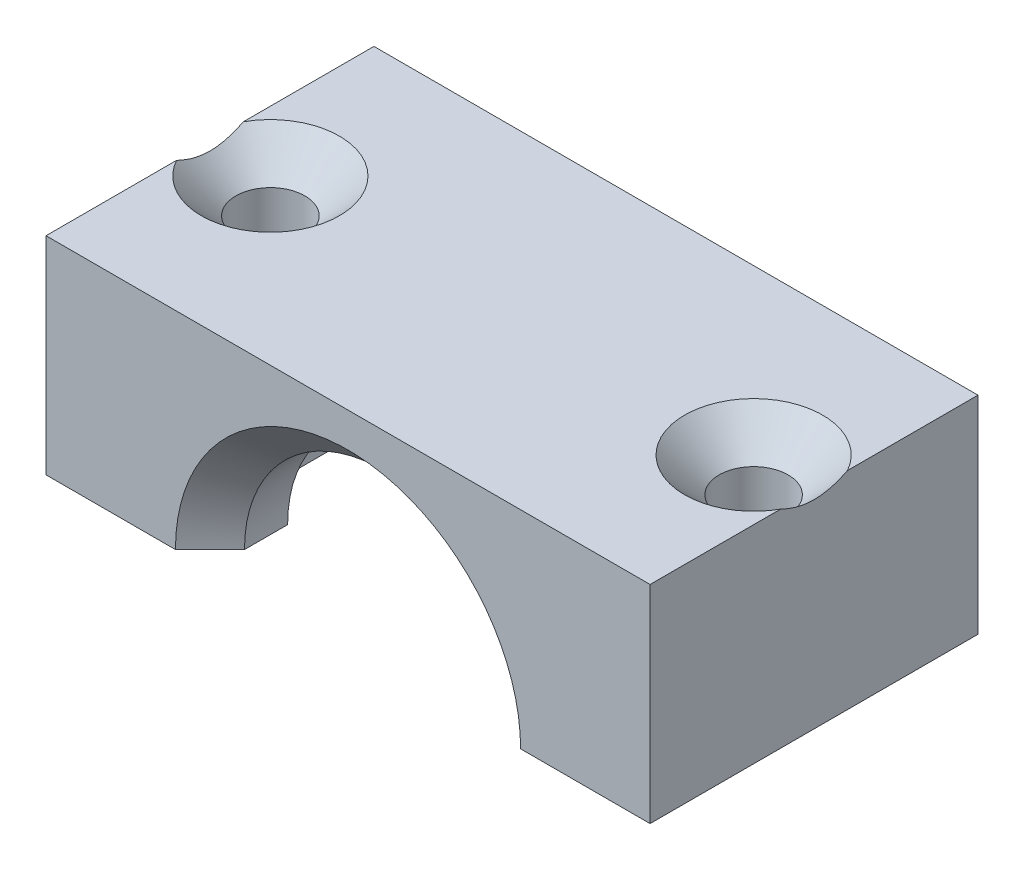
ISO-10303-21;
HEADER;
FILE_DESCRIPTION(('STEP AP214'),'2;1');
FILE_NAME('part.step','',(''),(''),'','','');
FILE_SCHEMA(('AUTOMOTIVE_DESIGN { 1 0 10303 214 1 1 1 1 }'));
ENDSEC;
DATA;
#1=APPLICATION_CONTEXT('core data for automotive mechanical design processes');
#2=APPLICATION_PROTOCOL_DEFINITION('international standard','automotive_design',2000,#1);
#3=PRODUCT_CONTEXT('',#1,'mechanical');
#4=PRODUCT('Part','Part','',(#3));
#5=PRODUCT_RELATED_PRODUCT_CATEGORY('part','',(#4));
#6=PRODUCT_DEFINITION_FORMATION('','',#4);
#7=PRODUCT_DEFINITION_CONTEXT('part definition',#1,'design');
#8=PRODUCT_DEFINITION('design','',#6,#7);
#9=PRODUCT_DEFINITION_SHAPE('','',#8);
#10=(LENGTH_UNIT() NAMED_UNIT(*) SI_UNIT(.MILLI.,.METRE.));
#11=(NAMED_UNIT(*) PLANE_ANGLE_UNIT() SI_UNIT($,.RADIAN.));
#12=(NAMED_UNIT(*) SI_UNIT($,.STERADIAN.) SOLID_ANGLE_UNIT());
#13=UNCERTAINTY_MEASURE_WITH_UNIT(LENGTH_MEASURE(1.E-05),#10,'distance_accuracy_value','');
#14=(GEOMETRIC_REPRESENTATION_CONTEXT(3) GLOBAL_UNCERTAINTY_ASSIGNED_CONTEXT((#13)) GLOBAL_UNIT_ASSIGNED_CONTEXT((#10,
#11,#12)) REPRESENTATION_CONTEXT('',''));
#15=CARTESIAN_POINT('',(0.,0.,0.));
#16=DIRECTION('',(0.,0.,1.));
#17=DIRECTION('',(1.,0.,0.));
#18=AXIS2_PLACEMENT_3D('',#15,#16,#17);
#19=CARTESIAN_POINT('',(0.,0.,-4.75));
#20=DIRECTION('',(0.,0.,1.));
#21=DIRECTION('',(1.,0.,0.));
#22=AXIS2_PLACEMENT_3D('',#19,#20,#21);
#23=CYLINDRICAL_SURFACE('',#22,4.);
#24=DIRECTION('',(0.,0.,1.));
#25=VECTOR('',#24,1.);
#26=CARTESIAN_POINT('',(-4.,0.,-4.75));
#27=LINE('',#26,#25);
#28=CARTESIAN_POINT('',(-4.,0.,-2.5));
#29=VERTEX_POINT('',#28);
#30=CARTESIAN_POINT('',(-4.,0.,-3.75));
#31=VERTEX_POINT('',#30);
#32=EDGE_CURVE('E161',#29,#31,#27,.F.);
#33=ORIENTED_EDGE('',*,*,#32,.T.);
#34=CARTESIAN_POINT('',(0.,0.,-3.75));
#35=DIRECTION('',(0.,0.,-1.));
#36=DIRECTION('',(-1.,0.,0.));
#37=AXIS2_PLACEMENT_3D('',#34,#35,#36);
#38=CIRCLE('',#37,4.);
#39=CARTESIAN_POINT('',(4.,0.,-3.75));
#40=VERTEX_POINT('',#39);
#41=EDGE_CURVE('E263',#31,#40,#38,.T.);
#42=ORIENTED_EDGE('',*,*,#41,.T.);
#43=DIRECTION('',(0.,0.,1.));
#44=VECTOR('',#43,1.);
#45=CARTESIAN_POINT('',(4.,0.,-4.75));
#46=LINE('',#45,#44);
#47=CARTESIAN_POINT('',(4.,0.,-2.5));
#48=VERTEX_POINT('',#47);
#49=EDGE_CURVE('E170',#40,#48,#46,.T.);
#50=ORIENTED_EDGE('',*,*,#49,.T.);
#51=CARTESIAN_POINT('',(0.,0.,-2.5));
#52=DIRECTION('',(0.,0.,1.));
#53=DIRECTION('',(1.,0.,0.));
#54=AXIS2_PLACEMENT_3D('',#51,#52,#53);
#55=CIRCLE('',#54,4.);
#56=EDGE_CURVE('E142',#29,#48,#55,.F.);
#57=ORIENTED_EDGE('',*,*,#56,.F.);
#58=EDGE_LOOP('',(#33,#42,#50,#57));
#59=FACE_BOUND('',#58,.T.);
#60=ADVANCED_FACE('F34',(#59),#23,.F.);
#61=CARTESIAN_POINT('',(-8.75,0.,-4.75));
#62=DIRECTION('',(0.,-1.,0.));
#63=DIRECTION('',(1.,0.,0.));
#64=AXIS2_PLACEMENT_3D('',#61,#62,#63);
#65=PLANE('',#64);
#66=CARTESIAN_POINT('',(7.,0.,0.));
#67=DIRECTION('',(0.,1.,0.));
#68=DIRECTION('',(0.,0.,1.));
#69=AXIS2_PLACEMENT_3D('',#66,#67,#68);
#70=CIRCLE('',#69,1.);
#71=CARTESIAN_POINT('',(7.,0.,0.999999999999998));
#72=VERTEX_POINT('',#71);
#73=EDGE_CURVE('E284',#72,#72,#70,.T.);
#74=ORIENTED_EDGE('',*,*,#73,.T.);
#75=EDGE_LOOP('',(#74));
#76=FACE_BOUND('',#75,.T.);
#77=ORIENTED_EDGE('',*,*,#49,.F.);
#78=DIRECTION('',(-0.707106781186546,0.,0.707106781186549));
#79=VECTOR('',#78,1.);
#80=CARTESIAN_POINT('',(0.,0.,0.250000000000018));
#81=LINE('',#80,#79);
#82=CARTESIAN_POINT('',(5.,0.,-4.75));
#83=VERTEX_POINT('',#82);
#84=EDGE_CURVE('E266',#40,#83,#81,.F.);
#85=ORIENTED_EDGE('',*,*,#84,.T.);
#86=DIRECTION('',(1.,0.,0.));
#87=VECTOR('',#86,1.);
#88=CARTESIAN_POINT('',(-8.75,0.,-4.75));
#89=LINE('',#88,#87);
#90=CARTESIAN_POINT('',(8.75,0.,-4.75));
#91=VERTEX_POINT('',#90);
#92=EDGE_CURVE('E187',#83,#91,#89,.T.);
#93=ORIENTED_EDGE('',*,*,#92,.T.);
#94=DIRECTION('',(0.,0.,1.));
#95=VECTOR('',#94,1.);
#96=CARTESIAN_POINT('',(8.75,0.,-4.75));
#97=LINE('',#96,#95);
#98=CARTESIAN_POINT('',(8.75,0.,4.75));
#99=VERTEX_POINT('',#98);
#100=EDGE_CURVE('E206',#91,#99,#97,.T.);
#101=ORIENTED_EDGE('',*,*,#100,.T.);
#102=DIRECTION('',(1.,0.,0.));
#103=VECTOR('',#102,1.);
#104=CARTESIAN_POINT('',(-8.75,0.,4.75));
#105=LINE('',#104,#103);
#106=CARTESIAN_POINT('',(5.,0.,4.75));
#107=VERTEX_POINT('',#106);
#108=EDGE_CURVE('E175',#107,#99,#105,.T.);
#109=ORIENTED_EDGE('',*,*,#108,.F.);
#110=DIRECTION('',(0.707106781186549,0.,0.707106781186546));
#111=VECTOR('',#110,1.);
#112=CARTESIAN_POINT('',(0.,0.,-0.249999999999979));
#113=LINE('',#112,#111);
#114=CARTESIAN_POINT('',(4.,0.,3.75));
#115=VERTEX_POINT('',#114);
#116=EDGE_CURVE('E49',#107,#115,#113,.F.);
#117=ORIENTED_EDGE('',*,*,#116,.T.);
#118=CARTESIAN_POINT('',(4.,0.,2.5));
#119=VERTEX_POINT('',#118);
#120=EDGE_CURVE('E169',#119,#115,#46,.T.);
#121=ORIENTED_EDGE('',*,*,#120,.F.);
#122=DIRECTION('',(-1.,0.,0.));
#123=VECTOR('',#122,1.);
#124=CARTESIAN_POINT('',(-8.75,0.,2.5));
#125=LINE('',#124,#123);
#126=CARTESIAN_POINT('',(5.25,0.,2.5));
#127=VERTEX_POINT('',#126);
#128=EDGE_CURVE('E160',#127,#119,#125,.T.);
#129=ORIENTED_EDGE('',*,*,#128,.F.);
#130=DIRECTION('',(0.,0.,-1.));
#131=VECTOR('',#130,1.);
#132=CARTESIAN_POINT('',(5.25,0.,2.5));
#133=LINE('',#132,#131);
#134=CARTESIAN_POINT('',(5.25,0.,-2.5));
#135=VERTEX_POINT('',#134);
#136=EDGE_CURVE('E151',#127,#135,#133,.T.);
#137=ORIENTED_EDGE('',*,*,#136,.T.);
#138=DIRECTION('',(-1.,0.,0.));
#139=VECTOR('',#138,1.);
#140=CARTESIAN_POINT('',(-8.75,0.,-2.5));
#141=LINE('',#140,#139);
#142=EDGE_CURVE('E136',#135,#48,#141,.T.);
#143=ORIENTED_EDGE('',*,*,#142,.T.);
#144=EDGE_LOOP('',(#77,#85,#93,#101,#109,#117,#121,#129,#137,#143));
#145=FACE_BOUND('',#144,.T.);
#146=ADVANCED_FACE('F159',(#76,#145),#65,.T.);
#147=CARTESIAN_POINT('',(-8.75,0.,-4.75));
#148=DIRECTION('',(-1.,0.,0.));
#149=DIRECTION('',(0.,0.,1.));
#150=AXIS2_PLACEMENT_3D('',#147,#148,#149);
#151=PLANE('',#150);
#152=DIRECTION('',(0.,0.,1.));
#153=VECTOR('',#152,1.);
#154=CARTESIAN_POINT('',(-8.75,6.,-4.75));
#155=LINE('',#154,#153);
#156=CARTESIAN_POINT('',(-8.75,6.,0.968245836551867));
#157=VERTEX_POINT('',#156);
#158=CARTESIAN_POINT('',(-8.75,6.,4.75));
#159=VERTEX_POINT('',#158);
#160=EDGE_CURVE('E201',#157,#159,#155,.T.);
#161=ORIENTED_EDGE('',*,*,#160,.F.);
#162=CARTESIAN_POINT('',(-8.75,6.,0.968245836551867));
#163=CARTESIAN_POINT('',(-8.75,5.96758294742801,0.901237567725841));
#164=CARTESIAN_POINT('',(-8.75,5.93716677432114,0.833134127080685));
#165=CARTESIAN_POINT('',(-8.75,5.88165165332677,0.694404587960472));
#166=CARTESIAN_POINT('',(-8.75,5.85658091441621,0.6237672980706));
#167=CARTESIAN_POINT('',(-8.75,5.81374741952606,0.481362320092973));
#168=CARTESIAN_POINT('',(-8.75,5.79588455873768,0.409625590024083));
#169=CARTESIAN_POINT('',(-8.75,5.76848148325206,0.264692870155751));
#170=CARTESIAN_POINT('',(-8.75,5.75892286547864,0.191500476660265));
#171=CARTESIAN_POINT('',(-8.75,5.75029086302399,0.0633039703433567));
#172=CARTESIAN_POINT('',(-8.75,5.74916173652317,0.00843335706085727));
#173=CARTESIAN_POINT('',(-8.75,5.75206720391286,-0.101191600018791));
#174=CARTESIAN_POINT('',(-8.75,5.75610353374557,-0.155945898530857));
#175=CARTESIAN_POINT('',(-8.75,5.7691065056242,-0.264893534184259));
#176=CARTESIAN_POINT('',(-8.75,5.77807660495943,-0.3190864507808));
#177=CARTESIAN_POINT('',(-8.75,5.80046780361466,-0.42655427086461));
#178=CARTESIAN_POINT('',(-8.75,5.81389071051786,-0.479828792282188));
#179=CARTESIAN_POINT('',(-8.75,5.85109300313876,-0.607631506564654));
#180=CARTESIAN_POINT('',(-8.75,5.87684964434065,-0.681575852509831));
#181=CARTESIAN_POINT('',(-8.75,5.93435720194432,-0.826833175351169));
#182=CARTESIAN_POINT('',(-8.75,5.96608780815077,-0.898154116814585));
#183=CARTESIAN_POINT('',(-8.75,6.,-0.968245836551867));
#184=B_SPLINE_CURVE_WITH_KNOTS('',3,(#162,#163,#164,#165,#166,#167,#168,#169,#170,#171,#172,
#173,#174,#175,#176,#177,#178,#179,#180,#181,#182,#183),.UNSPECIFIED.,.F.,.F.,(4,2,2,2,2,2,2,2,
2,2,4),(0.,0.223453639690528,0.448058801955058,0.66942731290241,0.890303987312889,
1.05471694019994,1.21918516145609,1.38376877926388,1.54841929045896,1.78300476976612,
2.01680665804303),.UNSPECIFIED.);
#185=CARTESIAN_POINT('',(-8.75,6.,-0.968245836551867));
#186=VERTEX_POINT('',#185);
#187=EDGE_CURVE('E251',#157,#186,#184,.T.);
#188=ORIENTED_EDGE('',*,*,#187,.T.);
#189=CARTESIAN_POINT('',(-8.75,6.,-4.75));
#190=VERTEX_POINT('',#189);
#191=EDGE_CURVE('E198',#190,#186,#155,.T.);
#192=ORIENTED_EDGE('',*,*,#191,.F.);
#193=DIRECTION('',(0.,-1.,0.));
#194=VECTOR('',#193,1.);
#195=CARTESIAN_POINT('',(-8.75,0.,-4.75));
#196=LINE('',#195,#194);
#197=CARTESIAN_POINT('',(-8.75,0.,-4.75));
#198=VERTEX_POINT('',#197);
#199=EDGE_CURVE('E184',#190,#198,#196,.T.);
#200=ORIENTED_EDGE('',*,*,#199,.T.);
#201=DIRECTION('',(0.,0.,1.));
#202=VECTOR('',#201,1.);
#203=CARTESIAN_POINT('',(-8.75,0.,-4.75));
#204=LINE('',#203,#202);
#205=CARTESIAN_POINT('',(-8.75,0.,4.75));
#206=VERTEX_POINT('',#205);
#207=EDGE_CURVE('E197',#198,#206,#204,.T.);
#208=ORIENTED_EDGE('',*,*,#207,.T.);
#209=DIRECTION('',(0.,-1.,0.));
#210=VECTOR('',#209,1.);
#211=CARTESIAN_POINT('',(-8.75,0.,4.75));
#212=LINE('',#211,#210);
#213=EDGE_CURVE('E172',#159,#206,#212,.T.);
#214=ORIENTED_EDGE('',*,*,#213,.F.);
#215=EDGE_LOOP('',(#161,#188,#192,#200,#208,#214));
#216=FACE_BOUND('',#215,.T.);
#217=ADVANCED_FACE('F245',(#216),#151,.T.);
#218=CARTESIAN_POINT('',(-8.75,6.,-4.75));
#219=DIRECTION('',(0.,1.,0.));
#220=DIRECTION('',(0.,0.,1.));
#221=AXIS2_PLACEMENT_3D('',#218,#219,#220);
#222=PLANE('',#221);
#223=DIRECTION('',(0.,0.,1.));
#224=VECTOR('',#223,1.);
#225=CARTESIAN_POINT('',(8.75,6.,-4.75));
#226=LINE('',#225,#224);
#227=CARTESIAN_POINT('',(8.75,6.,0.968245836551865));
#228=VERTEX_POINT('',#227);
#229=CARTESIAN_POINT('',(8.75,6.,4.75));
#230=VERTEX_POINT('',#229);
#231=EDGE_CURVE('E205',#228,#230,#226,.T.);
#232=ORIENTED_EDGE('',*,*,#231,.F.);
#233=CARTESIAN_POINT('',(7.,6.,0.));
#234=DIRECTION('',(0.,1.,0.));
#235=DIRECTION('',(0.,0.,1.));
#236=AXIS2_PLACEMENT_3D('',#233,#234,#235);
#237=CIRCLE('',#236,2.00000000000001);
#238=CARTESIAN_POINT('',(8.75,6.,-0.96824583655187));
#239=VERTEX_POINT('',#238);
#240=EDGE_CURVE('E221',#228,#239,#237,.F.);
#241=ORIENTED_EDGE('',*,*,#240,.T.);
#242=CARTESIAN_POINT('',(8.75,6.,-4.75));
#243=VERTEX_POINT('',#242);
#244=EDGE_CURVE('E202',#243,#239,#226,.T.);
#245=ORIENTED_EDGE('',*,*,#244,.F.);
#246=DIRECTION('',(-1.,0.,0.));
#247=VECTOR('',#246,1.);
#248=CARTESIAN_POINT('',(-8.75,6.,-4.75));
#249=LINE('',#248,#247);
#250=EDGE_CURVE('E194',#243,#190,#249,.T.);
#251=ORIENTED_EDGE('',*,*,#250,.T.);
#252=ORIENTED_EDGE('',*,*,#191,.T.);
#253=CARTESIAN_POINT('',(-7.,6.,0.));
#254=DIRECTION('',(0.,1.,0.));
#255=DIRECTION('',(0.,0.,1.));
#256=AXIS2_PLACEMENT_3D('',#253,#254,#255);
#257=CIRCLE('',#256,2.00000000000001);
#258=EDGE_CURVE('E218',#186,#157,#257,.F.);
#259=ORIENTED_EDGE('',*,*,#258,.T.);
#260=ORIENTED_EDGE('',*,*,#160,.T.);
#261=DIRECTION('',(-1.,0.,0.));
#262=VECTOR('',#261,1.);
#263=CARTESIAN_POINT('',(-8.75,6.,4.75));
#264=LINE('',#263,#262);
#265=EDGE_CURVE('E181',#230,#159,#264,.T.);
#266=ORIENTED_EDGE('',*,*,#265,.F.);
#267=EDGE_LOOP('',(#232,#241,#245,#251,#252,#259,#260,#266));
#268=FACE_BOUND('',#267,.T.);
#269=ADVANCED_FACE('F319',(#268),#222,.T.);
#270=CARTESIAN_POINT('',(8.75,0.,-4.75));
#271=DIRECTION('',(1.,0.,0.));
#272=DIRECTION('',(0.,0.,-1.));
#273=AXIS2_PLACEMENT_3D('',#270,#271,#272);
#274=PLANE('',#273);
#275=ORIENTED_EDGE('',*,*,#244,.T.);
#276=CARTESIAN_POINT('',(8.75,6.,-0.96824583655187));
#277=CARTESIAN_POINT('',(8.75,5.96758294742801,-0.901237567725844));
#278=CARTESIAN_POINT('',(8.75,5.93716677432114,-0.833134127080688));
#279=CARTESIAN_POINT('',(8.75,5.88165165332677,-0.694404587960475));
#280=CARTESIAN_POINT('',(8.75,5.85658091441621,-0.623767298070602));
#281=CARTESIAN_POINT('',(8.75,5.81374741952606,-0.481362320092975));
#282=CARTESIAN_POINT('',(8.75,5.79588455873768,-0.409625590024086));
#283=CARTESIAN_POINT('',(8.75,5.76848148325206,-0.264692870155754));
#284=CARTESIAN_POINT('',(8.75,5.75892286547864,-0.191500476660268));
#285=CARTESIAN_POINT('',(8.75,5.75029086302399,-0.0633039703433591));
#286=CARTESIAN_POINT('',(8.75,5.74916173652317,-0.00843335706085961));
#287=CARTESIAN_POINT('',(8.75,5.75206720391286,0.101191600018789));
#288=CARTESIAN_POINT('',(8.75,5.75610353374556,0.155945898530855));
#289=CARTESIAN_POINT('',(8.75,5.7691065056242,0.264893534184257));
#290=CARTESIAN_POINT('',(8.75,5.77807660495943,0.319086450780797));
#291=CARTESIAN_POINT('',(8.75,5.80046780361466,0.426554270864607));
#292=CARTESIAN_POINT('',(8.75,5.81389071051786,0.479828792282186));
#293=CARTESIAN_POINT('',(8.75,5.85109300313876,0.607631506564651));
#294=CARTESIAN_POINT('',(8.75,5.87684964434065,0.681575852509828));
#295=CARTESIAN_POINT('',(8.75,5.93435720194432,0.826833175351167));
#296=CARTESIAN_POINT('',(8.75,5.96608780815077,0.898154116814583));
#297=CARTESIAN_POINT('',(8.75,6.,0.968245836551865));
#298=B_SPLINE_CURVE_WITH_KNOTS('',3,(#276,#277,#278,#279,#280,#281,#282,#283,#284,#285,#286,
#287,#288,#289,#290,#291,#292,#293,#294,#295,#296,#297),.UNSPECIFIED.,.F.,.F.,(4,2,2,2,2,2,2,2,
2,2,4),(0.,0.223453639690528,0.448058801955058,0.66942731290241,0.890303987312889,
1.05471694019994,1.21918516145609,1.38376877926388,1.54841929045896,1.78300476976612,
2.01680665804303),.UNSPECIFIED.);
#299=EDGE_CURVE('E224',#239,#228,#298,.T.);
#300=ORIENTED_EDGE('',*,*,#299,.T.);
#301=ORIENTED_EDGE('',*,*,#231,.T.);
#302=DIRECTION('',(0.,1.,0.));
#303=VECTOR('',#302,1.);
#304=CARTESIAN_POINT('',(8.75,0.,4.75));
#305=LINE('',#304,#303);
#306=EDGE_CURVE('E178',#99,#230,#305,.T.);
#307=ORIENTED_EDGE('',*,*,#306,.F.);
#308=ORIENTED_EDGE('',*,*,#100,.F.);
#309=DIRECTION('',(0.,1.,0.));
#310=VECTOR('',#309,1.);
#311=CARTESIAN_POINT('',(8.75,0.,-4.75));
#312=LINE('',#311,#310);
#313=EDGE_CURVE('E191',#91,#243,#312,.T.);
#314=ORIENTED_EDGE('',*,*,#313,.T.);
#315=EDGE_LOOP('',(#275,#300,#301,#307,#308,#314));
#316=FACE_BOUND('',#315,.T.);
#317=ADVANCED_FACE('F233',(#316),#274,.T.);
#318=CARTESIAN_POINT('',(-7.,0.,0.));
#319=DIRECTION('',(0.,1.,0.));
#320=DIRECTION('',(0.,0.,1.));
#321=AXIS2_PLACEMENT_3D('',#318,#319,#320);
#322=CIRCLE('',#321,1.);
#323=CARTESIAN_POINT('',(-7.,0.,1.));
#324=VERTEX_POINT('',#323);
#325=EDGE_CURVE('E156',#324,#324,#322,.T.);
#326=ORIENTED_EDGE('',*,*,#325,.T.);
#327=EDGE_LOOP('',(#326));
#328=FACE_BOUND('',#327,.T.);
#329=CARTESIAN_POINT('',(-5.,0.,-4.75));
#330=VERTEX_POINT('',#329);
#331=EDGE_CURVE('E188',#198,#330,#89,.T.);
#332=ORIENTED_EDGE('',*,*,#331,.T.);
#333=DIRECTION('',(-0.707106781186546,0.,-0.707106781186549));
#334=VECTOR('',#333,1.);
#335=CARTESIAN_POINT('',(0.,0.,0.250000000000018));
#336=LINE('',#335,#334);
#337=EDGE_CURVE('E261',#330,#31,#336,.F.);
#338=ORIENTED_EDGE('',*,*,#337,.T.);
#339=ORIENTED_EDGE('',*,*,#32,.F.);
#340=DIRECTION('',(-1.,0.,0.));
#341=VECTOR('',#340,1.);
#342=CARTESIAN_POINT('',(-8.75,0.,-2.5));
#343=LINE('',#342,#341);
#344=CARTESIAN_POINT('',(-5.25,0.,-2.5));
#345=VERTEX_POINT('',#344);
#346=EDGE_CURVE('E146',#29,#345,#343,.T.);
#347=ORIENTED_EDGE('',*,*,#346,.T.);
#348=DIRECTION('',(0.,0.,-1.));
#349=VECTOR('',#348,1.);
#350=CARTESIAN_POINT('',(-5.25,0.,2.5));
#351=LINE('',#350,#349);
#352=CARTESIAN_POINT('',(-5.25,0.,2.5));
#353=VERTEX_POINT('',#352);
#354=EDGE_CURVE('E154',#345,#353,#351,.F.);
#355=ORIENTED_EDGE('',*,*,#354,.T.);
#356=DIRECTION('',(-1.,0.,0.));
#357=VECTOR('',#356,1.);
#358=CARTESIAN_POINT('',(-8.75,0.,2.5));
#359=LINE('',#358,#357);
#360=CARTESIAN_POINT('',(-4.,0.,2.5));
#361=VERTEX_POINT('',#360);
#362=EDGE_CURVE('E145',#361,#353,#359,.T.);
#363=ORIENTED_EDGE('',*,*,#362,.F.);
#364=CARTESIAN_POINT('',(-4.,0.,3.75));
#365=VERTEX_POINT('',#364);
#366=EDGE_CURVE('E164',#365,#361,#27,.F.);
#367=ORIENTED_EDGE('',*,*,#366,.F.);
#368=DIRECTION('',(0.707106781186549,0.,-0.707106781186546));
#369=VECTOR('',#368,1.);
#370=CARTESIAN_POINT('',(0.,0.,-0.249999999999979));
#371=LINE('',#370,#369);
#372=CARTESIAN_POINT('',(-5.,0.,4.75));
#373=VERTEX_POINT('',#372);
#374=EDGE_CURVE('E259',#365,#373,#371,.F.);
#375=ORIENTED_EDGE('',*,*,#374,.T.);
#376=EDGE_CURVE('E176',#206,#373,#105,.T.);
#377=ORIENTED_EDGE('',*,*,#376,.F.);
#378=ORIENTED_EDGE('',*,*,#207,.F.);
#379=EDGE_LOOP('',(#332,#338,#339,#347,#355,#363,#367,#375,#377,#378));
#380=FACE_BOUND('',#379,.T.);
#381=ADVANCED_FACE('F276',(#328,#380),#65,.T.);
#382=CARTESIAN_POINT('',(0.,0.,-4.75));
#383=DIRECTION('',(0.,0.,-1.));
#384=DIRECTION('',(-1.,0.,0.));
#385=AXIS2_PLACEMENT_3D('',#382,#383,#384);
#386=PLANE('',#385);
#387=ORIENTED_EDGE('',*,*,#92,.F.);
#388=CARTESIAN_POINT('',(0.,0.,-4.75));
#389=DIRECTION('',(0.,0.,-1.));
#390=DIRECTION('',(-1.,0.,0.));
#391=AXIS2_PLACEMENT_3D('',#388,#389,#390);
#392=CIRCLE('',#391,5.);
#393=EDGE_CURVE('E256',#83,#330,#392,.F.);
#394=ORIENTED_EDGE('',*,*,#393,.T.);
#395=ORIENTED_EDGE('',*,*,#331,.F.);
#396=ORIENTED_EDGE('',*,*,#199,.F.);
#397=ORIENTED_EDGE('',*,*,#250,.F.);
#398=ORIENTED_EDGE('',*,*,#313,.F.);
#399=EDGE_LOOP('',(#387,#394,#395,#396,#397,#398));
#400=FACE_BOUND('',#399,.T.);
#401=ADVANCED_FACE('F313',(#400),#386,.T.);
#402=CARTESIAN_POINT('',(0.,0.,4.75));
#403=DIRECTION('',(0.,0.,-1.));
#404=DIRECTION('',(-1.,0.,0.));
#405=AXIS2_PLACEMENT_3D('',#402,#403,#404);
#406=PLANE('',#405);
#407=ORIENTED_EDGE('',*,*,#376,.T.);
#408=CARTESIAN_POINT('',(0.,0.,4.75));
#409=DIRECTION('',(0.,0.,-1.));
#410=DIRECTION('',(-1.,0.,0.));
#411=AXIS2_PLACEMENT_3D('',#408,#409,#410);
#412=CIRCLE('',#411,5.);
#413=EDGE_CURVE('E11',#373,#107,#412,.T.);
#414=ORIENTED_EDGE('',*,*,#413,.T.);
#415=ORIENTED_EDGE('',*,*,#108,.T.);
#416=ORIENTED_EDGE('',*,*,#306,.T.);
#417=ORIENTED_EDGE('',*,*,#265,.T.);
#418=ORIENTED_EDGE('',*,*,#213,.T.);
#419=EDGE_LOOP('',(#407,#414,#415,#416,#417,#418));
#420=FACE_BOUND('',#419,.T.);
#421=ADVANCED_FACE('F307',(#420),#406,.F.);
#422=ORIENTED_EDGE('',*,*,#120,.T.);
#423=CARTESIAN_POINT('',(0.,0.,3.75));
#424=DIRECTION('',(0.,0.,-1.));
#425=DIRECTION('',(-1.,0.,0.));
#426=AXIS2_PLACEMENT_3D('',#423,#424,#425);
#427=CIRCLE('',#426,4.);
#428=EDGE_CURVE('E42',#115,#365,#427,.F.);
#429=ORIENTED_EDGE('',*,*,#428,.T.);
#430=ORIENTED_EDGE('',*,*,#366,.T.);
#431=CARTESIAN_POINT('',(0.,0.,2.5));
#432=DIRECTION('',(0.,0.,1.));
#433=DIRECTION('',(1.,0.,0.));
#434=AXIS2_PLACEMENT_3D('',#431,#432,#433);
#435=CIRCLE('',#434,4.);
#436=EDGE_CURVE('E211',#361,#119,#435,.F.);
#437=ORIENTED_EDGE('',*,*,#436,.T.);
#438=EDGE_LOOP('',(#422,#429,#430,#437));
#439=FACE_BOUND('',#438,.T.);
#440=ADVANCED_FACE('F271',(#439),#23,.F.);
#441=CARTESIAN_POINT('',(0.,0.,2.5));
#442=DIRECTION('',(0.,0.,-1.));
#443=DIRECTION('',(-1.,0.,0.));
#444=AXIS2_PLACEMENT_3D('',#441,#442,#443);
#445=CYLINDRICAL_SURFACE('',#444,5.25);
#446=CARTESIAN_POINT('',(0.,0.,2.5));
#447=DIRECTION('',(0.,0.,1.));
#448=DIRECTION('',(1.,0.,0.));
#449=AXIS2_PLACEMENT_3D('',#446,#447,#448);
#450=CIRCLE('',#449,5.25);
#451=EDGE_CURVE('E155',#127,#353,#450,.T.);
#452=ORIENTED_EDGE('',*,*,#451,.T.);
#453=ORIENTED_EDGE('',*,*,#354,.F.);
#454=CARTESIAN_POINT('',(0.,0.,-2.5));
#455=DIRECTION('',(0.,0.,1.));
#456=DIRECTION('',(1.,0.,0.));
#457=AXIS2_PLACEMENT_3D('',#454,#455,#456);
#458=CIRCLE('',#457,5.25);
#459=EDGE_CURVE('E139',#135,#345,#458,.T.);
#460=ORIENTED_EDGE('',*,*,#459,.F.);
#461=ORIENTED_EDGE('',*,*,#136,.F.);
#462=EDGE_LOOP('',(#452,#453,#460,#461));
#463=FACE_BOUND('',#462,.T.);
#464=ADVANCED_FACE('F150',(#463),#445,.F.);
#465=CARTESIAN_POINT('',(0.,0.,2.5));
#466=DIRECTION('',(0.,0.,1.));
#467=DIRECTION('',(1.,0.,0.));
#468=AXIS2_PLACEMENT_3D('',#465,#466,#467);
#469=PLANE('',#468);
#470=ORIENTED_EDGE('',*,*,#128,.T.);
#471=ORIENTED_EDGE('',*,*,#436,.F.);
#472=ORIENTED_EDGE('',*,*,#362,.T.);
#473=ORIENTED_EDGE('',*,*,#451,.F.);
#474=EDGE_LOOP('',(#470,#471,#472,#473));
#475=FACE_BOUND('',#474,.T.);
#476=ADVANCED_FACE('F312',(#475),#469,.F.);
#477=CARTESIAN_POINT('',(0.,0.,-2.5));
#478=DIRECTION('',(0.,0.,1.));
#479=DIRECTION('',(1.,0.,0.));
#480=AXIS2_PLACEMENT_3D('',#477,#478,#479);
#481=PLANE('',#480);
#482=ORIENTED_EDGE('',*,*,#459,.T.);
#483=ORIENTED_EDGE('',*,*,#346,.F.);
#484=ORIENTED_EDGE('',*,*,#56,.T.);
#485=ORIENTED_EDGE('',*,*,#142,.F.);
#486=EDGE_LOOP('',(#482,#483,#484,#485));
#487=FACE_BOUND('',#486,.T.);
#488=ADVANCED_FACE('F138',(#487),#481,.T.);
#489=CARTESIAN_POINT('',(-7.,0.,0.));
#490=DIRECTION('',(0.,1.,0.));
#491=DIRECTION('',(0.,0.,1.));
#492=AXIS2_PLACEMENT_3D('',#489,#490,#491);
#493=CYLINDRICAL_SURFACE('',#492,1.);
#494=CARTESIAN_POINT('',(-7.,5.,0.));
#495=DIRECTION('',(0.,1.,0.));
#496=DIRECTION('',(0.,0.,1.));
#497=AXIS2_PLACEMENT_3D('',#494,#495,#496);
#498=CIRCLE('',#497,1.);
#499=CARTESIAN_POINT('',(-7.,5.,1.));
#500=VERTEX_POINT('',#499);
#501=EDGE_CURVE('E231',#500,#500,#498,.T.);
#502=ORIENTED_EDGE('',*,*,#501,.T.);
#503=EDGE_LOOP('',(#502));
#504=FACE_BOUND('',#503,.T.);
#505=ORIENTED_EDGE('',*,*,#325,.F.);
#506=EDGE_LOOP('',(#505));
#507=FACE_BOUND('',#506,.T.);
#508=ADVANCED_FACE('F290',(#504,#507),#493,.F.);
#509=CARTESIAN_POINT('',(7.,0.,0.));
#510=DIRECTION('',(0.,1.,0.));
#511=DIRECTION('',(0.,0.,1.));
#512=AXIS2_PLACEMENT_3D('',#509,#510,#511);
#513=CYLINDRICAL_SURFACE('',#512,1.);
#514=CARTESIAN_POINT('',(7.,5.,0.));
#515=DIRECTION('',(0.,1.,0.));
#516=DIRECTION('',(0.,0.,1.));
#517=AXIS2_PLACEMENT_3D('',#514,#515,#516);
#518=CIRCLE('',#517,1.);
#519=CARTESIAN_POINT('',(7.,5.,0.999999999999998));
#520=VERTEX_POINT('',#519);
#521=EDGE_CURVE('E215',#520,#520,#518,.T.);
#522=ORIENTED_EDGE('',*,*,#521,.T.);
#523=EDGE_LOOP('',(#522));
#524=FACE_BOUND('',#523,.T.);
#525=ORIENTED_EDGE('',*,*,#73,.F.);
#526=EDGE_LOOP('',(#525));
#527=FACE_BOUND('',#526,.T.);
#528=ADVANCED_FACE('F243',(#524,#527),#513,.F.);
#529=CARTESIAN_POINT('',(7.,5.,0.));
#530=DIRECTION('',(0.,1.,0.));
#531=DIRECTION('',(0.,0.,1.));
#532=AXIS2_PLACEMENT_3D('',#529,#530,#531);
#533=CONICAL_SURFACE('',#532,1.,0.785398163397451);
#534=ORIENTED_EDGE('',*,*,#299,.F.);
#535=ORIENTED_EDGE('',*,*,#240,.F.);
#536=EDGE_LOOP('',(#534,#535));
#537=FACE_BOUND('',#536,.T.);
#538=ORIENTED_EDGE('',*,*,#521,.F.);
#539=EDGE_LOOP('',(#538));
#540=FACE_BOUND('',#539,.T.);
#541=ADVANCED_FACE('F237',(#537,#540),#533,.F.);
#542=CARTESIAN_POINT('',(-7.,5.,0.));
#543=DIRECTION('',(0.,1.,0.));
#544=DIRECTION('',(0.,0.,1.));
#545=AXIS2_PLACEMENT_3D('',#542,#543,#544);
#546=CONICAL_SURFACE('',#545,1.,0.785398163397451);
#547=ORIENTED_EDGE('',*,*,#187,.F.);
#548=ORIENTED_EDGE('',*,*,#258,.F.);
#549=EDGE_LOOP('',(#547,#548));
#550=FACE_BOUND('',#549,.T.);
#551=ORIENTED_EDGE('',*,*,#501,.F.);
#552=EDGE_LOOP('',(#551));
#553=FACE_BOUND('',#552,.T.);
#554=ADVANCED_FACE('F242',(#550,#553),#546,.F.);
#555=CARTESIAN_POINT('',(0.,0.,-4.75));
#556=DIRECTION('',(0.,0.,-1.));
#557=DIRECTION('',(-1.,0.,0.));
#558=AXIS2_PLACEMENT_3D('',#555,#556,#557);
#559=CONICAL_SURFACE('',#558,5.,0.785398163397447);
#560=ORIENTED_EDGE('',*,*,#84,.F.);
#561=ORIENTED_EDGE('',*,*,#41,.F.);
#562=ORIENTED_EDGE('',*,*,#337,.F.);
#563=ORIENTED_EDGE('',*,*,#393,.F.);
#564=EDGE_LOOP('',(#560,#561,#562,#563));
#565=FACE_BOUND('',#564,.T.);
#566=ADVANCED_FACE('F249',(#565),#559,.F.);
#567=CARTESIAN_POINT('',(0.,0.,3.75));
#568=DIRECTION('',(0.,0.,1.));
#569=DIRECTION('',(1.,0.,0.));
#570=AXIS2_PLACEMENT_3D('',#567,#568,#569);
#571=CONICAL_SURFACE('',#570,4.,0.785398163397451);
#572=ORIENTED_EDGE('',*,*,#116,.F.);
#573=ORIENTED_EDGE('',*,*,#413,.F.);
#574=ORIENTED_EDGE('',*,*,#374,.F.);
#575=ORIENTED_EDGE('',*,*,#428,.F.);
#576=EDGE_LOOP('',(#572,#573,#574,#575));
#577=FACE_BOUND('',#576,.T.);
#578=ADVANCED_FACE('F36',(#577),#571,.F.);
#579=CLOSED_SHELL('',(#60,#146,#217,#269,#317,#381,#401,#421,#440,#464,#476,#488,#508,#528,#541,
#554,#566,#578));
#580=MANIFOLD_SOLID_BREP('B2',#579);
#581=ADVANCED_BREP_SHAPE_REPRESENTATION('',(#18,#580),#14);
#582=SHAPE_DEFINITION_REPRESENTATION(#9,#581);
ENDSEC;
END-ISO-10303-21;
